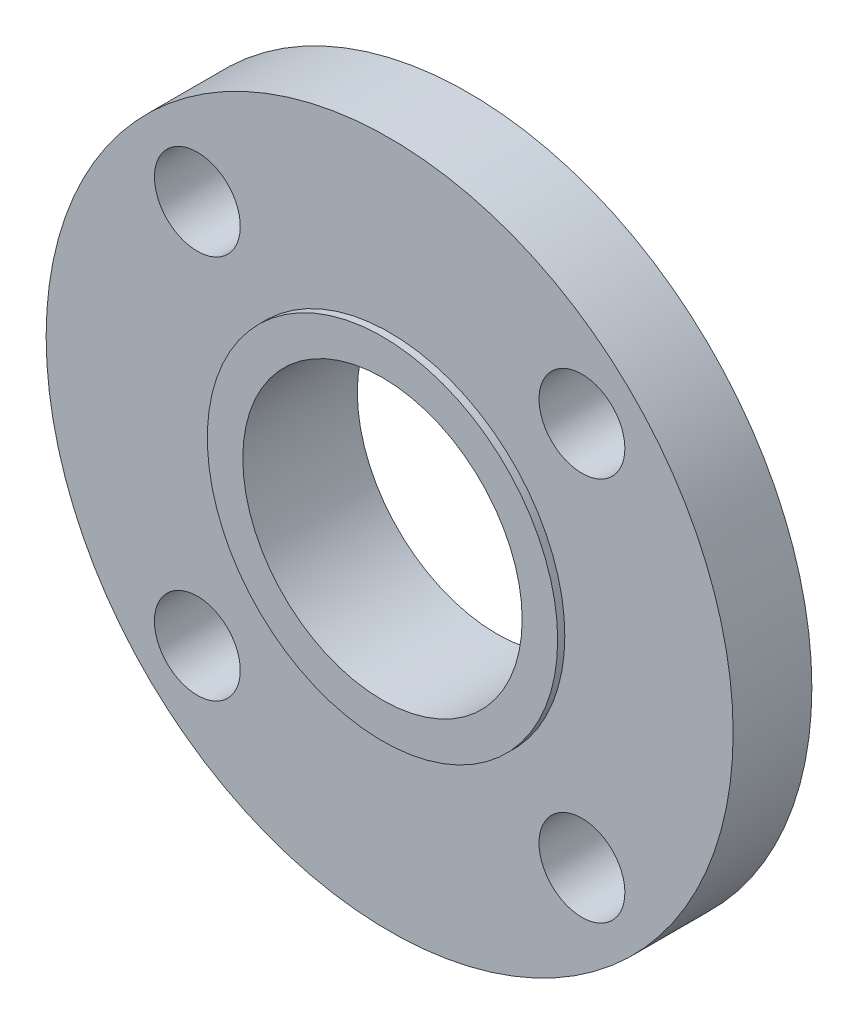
ISO-10303-21;
HEADER;
FILE_DESCRIPTION(('STEP AP214'),'2;1');
FILE_NAME('part.step','',(''),(''),'','','');
FILE_SCHEMA(('AUTOMOTIVE_DESIGN { 1 0 10303 214 1 1 1 1 }'));
ENDSEC;
DATA;
#1=APPLICATION_CONTEXT('core data for automotive mechanical design processes');
#2=APPLICATION_PROTOCOL_DEFINITION('international standard','automotive_design',2000,#1);
#3=PRODUCT_CONTEXT('',#1,'mechanical');
#4=PRODUCT('Part','Part','',(#3));
#5=PRODUCT_RELATED_PRODUCT_CATEGORY('part','',(#4));
#6=PRODUCT_DEFINITION_FORMATION('','',#4);
#7=PRODUCT_DEFINITION_CONTEXT('part definition',#1,'design');
#8=PRODUCT_DEFINITION('design','',#6,#7);
#9=PRODUCT_DEFINITION_SHAPE('','',#8);
#10=(LENGTH_UNIT() NAMED_UNIT(*) SI_UNIT(.MILLI.,.METRE.));
#11=(NAMED_UNIT(*) PLANE_ANGLE_UNIT() SI_UNIT($,.RADIAN.));
#12=(NAMED_UNIT(*) SI_UNIT($,.STERADIAN.) SOLID_ANGLE_UNIT());
#13=UNCERTAINTY_MEASURE_WITH_UNIT(LENGTH_MEASURE(1.E-05),#10,'distance_accuracy_value','');
#14=(GEOMETRIC_REPRESENTATION_CONTEXT(3) GLOBAL_UNCERTAINTY_ASSIGNED_CONTEXT((#13)) GLOBAL_UNIT_ASSIGNED_CONTEXT((#10,
#11,#12)) REPRESENTATION_CONTEXT('',''));
#15=CARTESIAN_POINT('',(0.,0.,0.));
#16=DIRECTION('',(0.,0.,1.));
#17=DIRECTION('',(1.,0.,0.));
#18=AXIS2_PLACEMENT_3D('',#15,#16,#17);
#19=CARTESIAN_POINT('',(0.,0.,-25.4));
#20=DIRECTION('',(0.,0.,1.));
#21=DIRECTION('',(1.,0.,0.));
#22=AXIS2_PLACEMENT_3D('',#19,#20,#21);
#23=CYLINDRICAL_SURFACE('',#22,38.862);
#24=CARTESIAN_POINT('',(0.,0.,-1.5875));
#25=DIRECTION('',(0.,0.,1.));
#26=DIRECTION('',(1.,0.,0.));
#27=AXIS2_PLACEMENT_3D('',#24,#25,#26);
#28=CIRCLE('',#27,38.862);
#29=CARTESIAN_POINT('',(38.862,0.,-1.5875));
#30=VERTEX_POINT('',#29);
#31=EDGE_CURVE('E10',#30,#30,#28,.F.);
#32=ORIENTED_EDGE('',*,*,#31,.F.);
#33=EDGE_LOOP('',(#32));
#34=FACE_BOUND('',#33,.T.);
#35=CARTESIAN_POINT('',(0.,0.,0.));
#36=DIRECTION('',(0.,0.,1.));
#37=DIRECTION('',(1.,0.,0.));
#38=AXIS2_PLACEMENT_3D('',#35,#36,#37);
#39=CIRCLE('',#38,38.862);
#40=CARTESIAN_POINT('',(38.862,0.,0.));
#41=VERTEX_POINT('',#40);
#42=EDGE_CURVE('E42',#41,#41,#39,.T.);
#43=ORIENTED_EDGE('',*,*,#42,.F.);
#44=EDGE_LOOP('',(#43));
#45=FACE_BOUND('',#44,.T.);
#46=ADVANCED_FACE('F30',(#34,#45),#23,.T.);
#47=CARTESIAN_POINT('',(0.,0.,0.));
#48=DIRECTION('',(0.,0.,1.));
#49=DIRECTION('',(1.,0.,0.));
#50=AXIS2_PLACEMENT_3D('',#47,#48,#49);
#51=PLANE('',#50);
#52=CARTESIAN_POINT('',(0.,0.,0.));
#53=DIRECTION('',(0.,0.,1.));
#54=DIRECTION('',(1.,0.,0.));
#55=AXIS2_PLACEMENT_3D('',#52,#53,#54);
#56=CIRCLE('',#55,30.988);
#57=CARTESIAN_POINT('',(30.988,0.,0.));
#58=VERTEX_POINT('',#57);
#59=EDGE_CURVE('E50',#58,#58,#56,.T.);
#60=ORIENTED_EDGE('',*,*,#59,.F.);
#61=EDGE_LOOP('',(#60));
#62=FACE_BOUND('',#61,.T.);
#63=ORIENTED_EDGE('',*,*,#42,.T.);
#64=EDGE_LOOP('',(#63));
#65=FACE_BOUND('',#64,.T.);
#66=ADVANCED_FACE('F86',(#62,#65),#51,.T.);
#67=CARTESIAN_POINT('',(0.,0.,-234.57614690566));
#68=DIRECTION('',(0.,0.,1.));
#69=DIRECTION('',(1.,0.,0.));
#70=AXIS2_PLACEMENT_3D('',#67,#68,#69);
#71=CYLINDRICAL_SURFACE('',#70,76.2);
#72=CARTESIAN_POINT('',(0.,0.,-19.05));
#73=DIRECTION('',(0.,0.,1.));
#74=DIRECTION('',(1.,0.,0.));
#75=AXIS2_PLACEMENT_3D('',#72,#73,#74);
#76=CIRCLE('',#75,76.2);
#77=CARTESIAN_POINT('',(76.2,0.,-19.05));
#78=VERTEX_POINT('',#77);
#79=EDGE_CURVE('E54',#78,#78,#76,.F.);
#80=CARTESIAN_POINT('',(0.,0.,-1.5875));
#81=DIRECTION('',(0.,0.,1.));
#82=DIRECTION('',(1.,0.,0.));
#83=AXIS2_PLACEMENT_3D('',#80,#81,#82);
#84=CIRCLE('',#83,76.2);
#85=CARTESIAN_POINT('',(76.2,0.,-1.58750000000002));
#86=VERTEX_POINT('',#85);
#87=EDGE_CURVE('E49',#86,#86,#84,.T.);
#88=CARTESIAN_POINT('',(76.2,0.,-19.05));
#89=CARTESIAN_POINT('',(76.2,0.,-18.8680989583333));
#90=CARTESIAN_POINT('',(76.2,0.,-18.6861979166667));
#91=CARTESIAN_POINT('',(76.2,0.,-18.3223958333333));
#92=CARTESIAN_POINT('',(76.2,0.,-18.1404947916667));
#93=CARTESIAN_POINT('',(76.2,0.,-17.7766927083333));
#94=CARTESIAN_POINT('',(76.2,0.,-17.5947916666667));
#95=CARTESIAN_POINT('',(76.2,0.,-17.2309895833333));
#96=CARTESIAN_POINT('',(76.2,0.,-17.0490885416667));
#97=CARTESIAN_POINT('',(76.2,0.,-16.6852864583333));
#98=CARTESIAN_POINT('',(76.2,0.,-16.5033854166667));
#99=CARTESIAN_POINT('',(76.2,0.,-16.1395833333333));
#100=CARTESIAN_POINT('',(76.2,0.,-15.9576822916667));
#101=CARTESIAN_POINT('',(76.2,0.,-15.5938802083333));
#102=CARTESIAN_POINT('',(76.2,0.,-15.4119791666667));
#103=CARTESIAN_POINT('',(76.2,0.,-15.0481770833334));
#104=CARTESIAN_POINT('',(76.2,0.,-14.8662760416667));
#105=CARTESIAN_POINT('',(76.2,0.,-14.5024739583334));
#106=CARTESIAN_POINT('',(76.2,0.,-14.3205729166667));
#107=CARTESIAN_POINT('',(76.2,0.,-13.9567708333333));
#108=CARTESIAN_POINT('',(76.2,0.,-13.7748697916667));
#109=CARTESIAN_POINT('',(76.2,0.,-13.4110677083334));
#110=CARTESIAN_POINT('',(76.2,0.,-13.2291666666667));
#111=CARTESIAN_POINT('',(76.2,0.,-12.8653645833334));
#112=CARTESIAN_POINT('',(76.2,0.,-12.6834635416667));
#113=CARTESIAN_POINT('',(76.2,0.,-12.3196614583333));
#114=CARTESIAN_POINT('',(76.2,0.,-12.1377604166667));
#115=CARTESIAN_POINT('',(76.2,0.,-11.7739583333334));
#116=CARTESIAN_POINT('',(76.2,0.,-11.5920572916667));
#117=CARTESIAN_POINT('',(76.2,0.,-11.2282552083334));
#118=CARTESIAN_POINT('',(76.2,0.,-11.0463541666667));
#119=CARTESIAN_POINT('',(76.2,0.,-10.6825520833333));
#120=CARTESIAN_POINT('',(76.2,0.,-10.5006510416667));
#121=CARTESIAN_POINT('',(76.2,0.,-10.1368489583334));
#122=CARTESIAN_POINT('',(76.2,0.,-9.95494791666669));
#123=CARTESIAN_POINT('',(76.2,0.,-9.59114583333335));
#124=CARTESIAN_POINT('',(76.2,0.,-9.40924479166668));
#125=CARTESIAN_POINT('',(76.2,0.,-9.04544270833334));
#126=CARTESIAN_POINT('',(76.2,0.,-8.86354166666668));
#127=CARTESIAN_POINT('',(76.2,0.,-8.49973958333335));
#128=CARTESIAN_POINT('',(76.2,0.,-8.31783854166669));
#129=CARTESIAN_POINT('',(76.2,0.,-7.95403645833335));
#130=CARTESIAN_POINT('',(76.2,0.,-7.77213541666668));
#131=CARTESIAN_POINT('',(76.2,0.,-7.40833333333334));
#132=CARTESIAN_POINT('',(76.2,0.,-7.22643229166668));
#133=CARTESIAN_POINT('',(76.2,0.,-6.86263020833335));
#134=CARTESIAN_POINT('',(76.2,0.,-6.68072916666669));
#135=CARTESIAN_POINT('',(76.2,0.,-6.31692708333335));
#136=CARTESIAN_POINT('',(76.2,0.,-6.13502604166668));
#137=CARTESIAN_POINT('',(76.2,0.,-5.77122395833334));
#138=CARTESIAN_POINT('',(76.2,0.,-5.58932291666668));
#139=CARTESIAN_POINT('',(76.2,0.,-5.22552083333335));
#140=CARTESIAN_POINT('',(76.2,0.,-5.04361979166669));
#141=CARTESIAN_POINT('',(76.2,0.,-4.67981770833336));
#142=CARTESIAN_POINT('',(76.2,0.,-4.49791666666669));
#143=CARTESIAN_POINT('',(76.2,0.,-4.13411458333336));
#144=CARTESIAN_POINT('',(76.2,0.,-3.95221354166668));
#145=CARTESIAN_POINT('',(76.2,0.,-3.58841145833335));
#146=CARTESIAN_POINT('',(76.2,0.,-3.40651041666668));
#147=CARTESIAN_POINT('',(76.2,0.,-3.04270833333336));
#148=CARTESIAN_POINT('',(76.2,0.,-2.86080729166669));
#149=CARTESIAN_POINT('',(76.2,0.,-2.49700520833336));
#150=CARTESIAN_POINT('',(76.2,0.,-2.31510416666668));
#151=CARTESIAN_POINT('',(76.2,0.,-1.95130208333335));
#152=CARTESIAN_POINT('',(76.2,0.,-1.76940104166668));
#153=CARTESIAN_POINT('',(76.2,0.,-1.58750000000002));
#154=B_SPLINE_CURVE_WITH_KNOTS('',3,(#88,#89,#90,#91,#92,#93,#94,#95,#96,#97,#98,#99,#100,#101,
#102,#103,#104,#105,#106,#107,#108,#109,#110,#111,#112,#113,#114,#115,#116,#117,#118,#119,#120,
#121,#122,#123,#124,#125,#126,#127,#128,#129,#130,#131,#132,#133,#134,#135,#136,#137,#138,#139,
#140,#141,#142,#143,#144,#145,#146,#147,#148,#149,#150,#151,#152,#153),.UNSPECIFIED.,.F.,.F.,(4,
2,2,2,2,2,2,2,2,2,2,2,2,2,2,2,2,2,2,2,2,2,2,2,2,2,2,2,2,2,2,2,4),(0.,0.545703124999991,
1.09140625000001,1.637109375,2.18281249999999,2.72851562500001,3.27421875,3.81992187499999,
4.36562499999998,4.911328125,5.45703124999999,6.00273437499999,6.5484375,7.094140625,
7.63984374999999,8.18554687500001,8.73125,9.27695312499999,9.82265625,10.368359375,10.9140625,
11.459765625,12.00546875,12.551171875,13.096875,13.642578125,14.18828125,14.733984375,
15.2796875,15.825390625,16.37109375,16.916796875,17.4625),.UNSPECIFIED.);
#155=EDGE_CURVE('BSEAM83',#78,#86,#154,.T.);
#156=ORIENTED_EDGE('',*,*,#79,.F.);
#157=ORIENTED_EDGE('',*,*,#87,.F.);
#158=ORIENTED_EDGE('',*,*,#155,.T.);
#159=ORIENTED_EDGE('',*,*,#155,.F.);
#160=EDGE_LOOP('',(#156,#158,#157,#159));
#161=FACE_BOUND('',#160,.T.);
#162=ADVANCED_FACE('F83',(#161),#71,.T.);
#163=CARTESIAN_POINT('',(0.,0.,-1.5875));
#164=DIRECTION('',(0.,0.,1.));
#165=DIRECTION('',(1.,0.,0.));
#166=AXIS2_PLACEMENT_3D('',#163,#164,#165);
#167=PLANE('',#166);
#168=CARTESIAN_POINT('',(42.6562165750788,-42.6562165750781,-1.5875));
#169=DIRECTION('',(0.,0.,1.));
#170=DIRECTION('',(0.,-1.,0.));
#171=AXIS2_PLACEMENT_3D('',#168,#169,#170);
#172=CIRCLE('',#171,9.525);
#173=CARTESIAN_POINT('',(42.6562165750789,-52.1812165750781,-1.5875));
#174=VERTEX_POINT('',#173);
#175=EDGE_CURVE('E192',#174,#174,#172,.T.);
#176=ORIENTED_EDGE('',*,*,#175,.F.);
#177=EDGE_LOOP('',(#176));
#178=FACE_BOUND('',#177,.T.);
#179=CARTESIAN_POINT('',(-42.6562165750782,-42.6562165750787,-1.5875));
#180=DIRECTION('',(0.,0.,1.));
#181=DIRECTION('',(-1.,0.,0.));
#182=AXIS2_PLACEMENT_3D('',#179,#180,#181);
#183=CIRCLE('',#182,9.525);
#184=CARTESIAN_POINT('',(-52.1812165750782,-42.6562165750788,-1.5875));
#185=VERTEX_POINT('',#184);
#186=EDGE_CURVE('E186',#185,#185,#183,.T.);
#187=ORIENTED_EDGE('',*,*,#186,.F.);
#188=EDGE_LOOP('',(#187));
#189=FACE_BOUND('',#188,.T.);
#190=CARTESIAN_POINT('',(-42.6562165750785,42.6562165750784,-1.5875));
#191=DIRECTION('',(0.,0.,1.));
#192=DIRECTION('',(0.,1.,0.));
#193=AXIS2_PLACEMENT_3D('',#190,#191,#192);
#194=CIRCLE('',#193,9.525);
#195=CARTESIAN_POINT('',(-42.6562165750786,52.1812165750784,-1.5875));
#196=VERTEX_POINT('',#195);
#197=EDGE_CURVE('E177',#196,#196,#194,.T.);
#198=ORIENTED_EDGE('',*,*,#197,.F.);
#199=EDGE_LOOP('',(#198));
#200=FACE_BOUND('',#199,.T.);
#201=CARTESIAN_POINT('',(42.6562165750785,42.6562165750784,-1.5875));
#202=DIRECTION('',(0.,0.,1.));
#203=DIRECTION('',(1.,0.,0.));
#204=AXIS2_PLACEMENT_3D('',#201,#202,#203);
#205=CIRCLE('',#204,9.525);
#206=CARTESIAN_POINT('',(52.1812165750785,42.6562165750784,-1.5875));
#207=VERTEX_POINT('',#206);
#208=EDGE_CURVE('E61',#207,#207,#205,.T.);
#209=ORIENTED_EDGE('',*,*,#208,.F.);
#210=EDGE_LOOP('',(#209));
#211=FACE_BOUND('',#210,.T.);
#212=ORIENTED_EDGE('',*,*,#31,.T.);
#213=EDGE_LOOP('',(#212));
#214=FACE_BOUND('',#213,.T.);
#215=ORIENTED_EDGE('',*,*,#87,.T.);
#216=EDGE_LOOP('',(#215));
#217=FACE_BOUND('',#216,.T.);
#218=ADVANCED_FACE('F78',(#178,#189,#200,#211,#214,#217),#167,.T.);
#219=CARTESIAN_POINT('',(0.,0.,-19.05));
#220=DIRECTION('',(0.,0.,1.));
#221=DIRECTION('',(1.,0.,0.));
#222=AXIS2_PLACEMENT_3D('',#219,#220,#221);
#223=PLANE('',#222);
#224=CARTESIAN_POINT('',(42.6562165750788,-42.6562165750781,-19.05));
#225=DIRECTION('',(0.,0.,1.));
#226=DIRECTION('',(0.,-1.,0.));
#227=AXIS2_PLACEMENT_3D('',#224,#225,#226);
#228=CIRCLE('',#227,9.525);
#229=CARTESIAN_POINT('',(42.6562165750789,-52.1812165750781,-19.05));
#230=VERTEX_POINT('',#229);
#231=EDGE_CURVE('E189',#230,#230,#228,.T.);
#232=ORIENTED_EDGE('',*,*,#231,.T.);
#233=EDGE_LOOP('',(#232));
#234=FACE_BOUND('',#233,.T.);
#235=CARTESIAN_POINT('',(-42.6562165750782,-42.6562165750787,-19.05));
#236=DIRECTION('',(0.,0.,1.));
#237=DIRECTION('',(-1.,0.,0.));
#238=AXIS2_PLACEMENT_3D('',#235,#236,#237);
#239=CIRCLE('',#238,9.525);
#240=CARTESIAN_POINT('',(-52.1812165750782,-42.6562165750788,-19.05));
#241=VERTEX_POINT('',#240);
#242=EDGE_CURVE('E181',#241,#241,#239,.T.);
#243=ORIENTED_EDGE('',*,*,#242,.T.);
#244=EDGE_LOOP('',(#243));
#245=FACE_BOUND('',#244,.T.);
#246=CARTESIAN_POINT('',(-42.6562165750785,42.6562165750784,-19.05));
#247=DIRECTION('',(0.,0.,1.));
#248=DIRECTION('',(0.,1.,0.));
#249=AXIS2_PLACEMENT_3D('',#246,#247,#248);
#250=CIRCLE('',#249,9.525);
#251=CARTESIAN_POINT('',(-42.6562165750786,52.1812165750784,-19.05));
#252=VERTEX_POINT('',#251);
#253=EDGE_CURVE('E175',#252,#252,#250,.T.);
#254=ORIENTED_EDGE('',*,*,#253,.T.);
#255=EDGE_LOOP('',(#254));
#256=FACE_BOUND('',#255,.T.);
#257=CARTESIAN_POINT('',(42.6562165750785,42.6562165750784,-19.05));
#258=DIRECTION('',(0.,0.,1.));
#259=DIRECTION('',(1.,0.,0.));
#260=AXIS2_PLACEMENT_3D('',#257,#258,#259);
#261=CIRCLE('',#260,9.525);
#262=CARTESIAN_POINT('',(52.1812165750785,42.6562165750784,-19.05));
#263=VERTEX_POINT('',#262);
#264=EDGE_CURVE('E33',#263,#263,#261,.T.);
#265=ORIENTED_EDGE('',*,*,#264,.T.);
#266=EDGE_LOOP('',(#265));
#267=FACE_BOUND('',#266,.T.);
#268=CARTESIAN_POINT('',(0.,0.,-19.05));
#269=DIRECTION('',(0.,0.,1.));
#270=DIRECTION('',(1.,0.,0.));
#271=AXIS2_PLACEMENT_3D('',#268,#269,#270);
#272=CIRCLE('',#271,38.862);
#273=CARTESIAN_POINT('',(38.862,0.,-19.05));
#274=VERTEX_POINT('',#273);
#275=EDGE_CURVE('E45',#274,#274,#272,.F.);
#276=ORIENTED_EDGE('',*,*,#275,.F.);
#277=EDGE_LOOP('',(#276));
#278=FACE_BOUND('',#277,.T.);
#279=ORIENTED_EDGE('',*,*,#79,.T.);
#280=EDGE_LOOP('',(#279));
#281=FACE_BOUND('',#280,.T.);
#282=ADVANCED_FACE('F74',(#234,#245,#256,#267,#278,#281),#223,.F.);
#283=CARTESIAN_POINT('',(0.,0.,-25.4));
#284=DIRECTION('',(0.,0.,1.));
#285=DIRECTION('',(1.,0.,0.));
#286=AXIS2_PLACEMENT_3D('',#283,#284,#285);
#287=PLANE('',#286);
#288=CARTESIAN_POINT('',(0.,0.,-25.4));
#289=DIRECTION('',(0.,0.,1.));
#290=DIRECTION('',(1.,0.,0.));
#291=AXIS2_PLACEMENT_3D('',#288,#289,#290);
#292=CIRCLE('',#291,30.988);
#293=CARTESIAN_POINT('',(30.988,0.,-25.4));
#294=VERTEX_POINT('',#293);
#295=EDGE_CURVE('E47',#294,#294,#292,.T.);
#296=ORIENTED_EDGE('',*,*,#295,.T.);
#297=EDGE_LOOP('',(#296));
#298=FACE_BOUND('',#297,.T.);
#299=CARTESIAN_POINT('',(0.,0.,-25.4));
#300=DIRECTION('',(0.,0.,1.));
#301=DIRECTION('',(1.,0.,0.));
#302=AXIS2_PLACEMENT_3D('',#299,#300,#301);
#303=CIRCLE('',#302,38.862);
#304=CARTESIAN_POINT('',(38.862,0.,-25.4));
#305=VERTEX_POINT('',#304);
#306=EDGE_CURVE('E37',#305,#305,#303,.T.);
#307=ORIENTED_EDGE('',*,*,#306,.F.);
#308=EDGE_LOOP('',(#307));
#309=FACE_BOUND('',#308,.T.);
#310=ADVANCED_FACE('F77',(#298,#309),#287,.F.);
#311=ORIENTED_EDGE('',*,*,#306,.T.);
#312=EDGE_LOOP('',(#311));
#313=FACE_BOUND('',#312,.T.);
#314=ORIENTED_EDGE('',*,*,#275,.T.);
#315=EDGE_LOOP('',(#314));
#316=FACE_BOUND('',#315,.T.);
#317=ADVANCED_FACE('F72',(#313,#316),#23,.T.);
#318=CARTESIAN_POINT('',(0.,0.,19.5213114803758));
#319=DIRECTION('',(0.,0.,1.));
#320=DIRECTION('',(1.,0.,0.));
#321=AXIS2_PLACEMENT_3D('',#318,#319,#320);
#322=CYLINDRICAL_SURFACE('',#321,30.988);
#323=ORIENTED_EDGE('',*,*,#59,.T.);
#324=EDGE_LOOP('',(#323));
#325=FACE_BOUND('',#324,.T.);
#326=ORIENTED_EDGE('',*,*,#295,.F.);
#327=EDGE_LOOP('',(#326));
#328=FACE_BOUND('',#327,.T.);
#329=ADVANCED_FACE('F105',(#325,#328),#322,.F.);
#330=CARTESIAN_POINT('',(42.6562165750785,42.6562165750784,-25.4));
#331=DIRECTION('',(0.,0.,1.));
#332=DIRECTION('',(1.,0.,0.));
#333=AXIS2_PLACEMENT_3D('',#330,#331,#332);
#334=CYLINDRICAL_SURFACE('',#333,9.525);
#335=ORIENTED_EDGE('',*,*,#208,.T.);
#336=EDGE_LOOP('',(#335));
#337=FACE_BOUND('',#336,.T.);
#338=ORIENTED_EDGE('',*,*,#264,.F.);
#339=EDGE_LOOP('',(#338));
#340=FACE_BOUND('',#339,.T.);
#341=ADVANCED_FACE('F111',(#337,#340),#334,.F.);
#342=CARTESIAN_POINT('',(-42.6562165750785,42.6562165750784,-25.4));
#343=DIRECTION('',(0.,0.,1.));
#344=DIRECTION('',(0.,1.,0.));
#345=AXIS2_PLACEMENT_3D('',#342,#343,#344);
#346=CYLINDRICAL_SURFACE('',#345,9.525);
#347=ORIENTED_EDGE('',*,*,#197,.T.);
#348=EDGE_LOOP('',(#347));
#349=FACE_BOUND('',#348,.T.);
#350=ORIENTED_EDGE('',*,*,#253,.F.);
#351=EDGE_LOOP('',(#350));
#352=FACE_BOUND('',#351,.T.);
#353=ADVANCED_FACE('F133',(#349,#352),#346,.F.);
#354=CARTESIAN_POINT('',(-42.6562165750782,-42.6562165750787,-25.4));
#355=DIRECTION('',(0.,0.,1.));
#356=DIRECTION('',(-1.,0.,0.));
#357=AXIS2_PLACEMENT_3D('',#354,#355,#356);
#358=CYLINDRICAL_SURFACE('',#357,9.525);
#359=ORIENTED_EDGE('',*,*,#186,.T.);
#360=EDGE_LOOP('',(#359));
#361=FACE_BOUND('',#360,.T.);
#362=ORIENTED_EDGE('',*,*,#242,.F.);
#363=EDGE_LOOP('',(#362));
#364=FACE_BOUND('',#363,.T.);
#365=ADVANCED_FACE('F138',(#361,#364),#358,.F.);
#366=CARTESIAN_POINT('',(42.6562165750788,-42.6562165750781,-25.4));
#367=DIRECTION('',(0.,0.,1.));
#368=DIRECTION('',(0.,-1.,0.));
#369=AXIS2_PLACEMENT_3D('',#366,#367,#368);
#370=CYLINDRICAL_SURFACE('',#369,9.525);
#371=ORIENTED_EDGE('',*,*,#175,.T.);
#372=EDGE_LOOP('',(#371));
#373=FACE_BOUND('',#372,.T.);
#374=ORIENTED_EDGE('',*,*,#231,.F.);
#375=EDGE_LOOP('',(#374));
#376=FACE_BOUND('',#375,.T.);
#377=ADVANCED_FACE('F150',(#373,#376),#370,.F.);
#378=CLOSED_SHELL('',(#46,#66,#162,#218,#282,#310,#317,#329,#341,#353,#365,#377));
#379=MANIFOLD_SOLID_BREP('B2',#378);
#380=ADVANCED_BREP_SHAPE_REPRESENTATION('',(#18,#379),#14);
#381=SHAPE_DEFINITION_REPRESENTATION(#9,#380);
ENDSEC;
END-ISO-10303-21;
